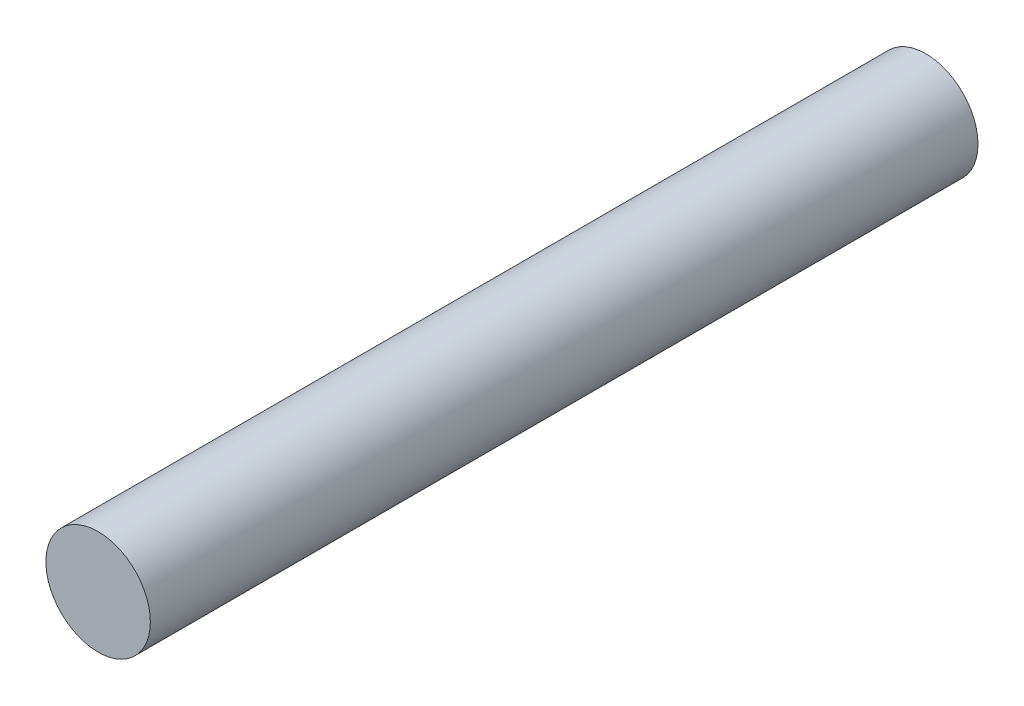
from build123d import *

# Parameters (mm, degrees)
SKETCH1_R           = 2
BOSS_EXTRUDE1_DEPTH = 15.85


with BuildPart() as part:
    # Sketch1 → Boss-Extrude1 (new, symmetric)
    with BuildSketch(Plane.XY):
        Circle(SKETCH1_R)
    extrude(amount=BOSS_EXTRUDE1_DEPTH, both=True)


solid = part.part
